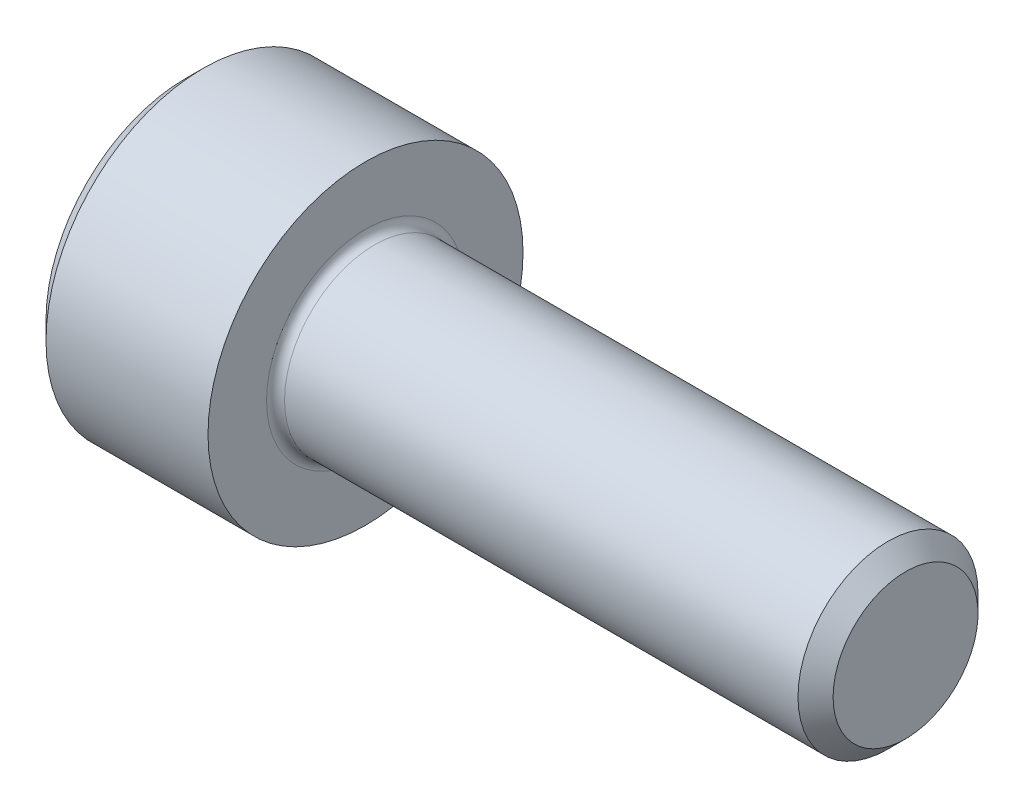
from build123d import *

# Parameters (mm, degrees)
FILLET1_R   = 0.2
HEX_2_DEPTH = 2


with BuildPart() as part:
    # BodySke → Base-Revolve (revolve)
    with BuildSketch(Plane.XY, mode=Mode.PRIVATE) as base_revolve_sk:
        Polygon((0, 0), (0, 3.1), (0.4, 3.5), (4, 3.5), (4, 2), (15.61, 2), (16, 1.61), (16, 0), align=None)
    revolve(base_revolve_sk.sketch.rotate(Axis((-31.75, 0, 0), (1, 0, 0)), 90), axis=Axis((-31.75, 0, 0), (1, 0, 0)))

    # Fillet1
    fillet1_edges = [part.edges().sort_by_distance(p)[0] for p in [
        (4, 0, -2),
    ]]
    fillet(fillet1_edges, radius=FILLET1_R)

    # Sketch2 → Hex-PreBroach (revolve, cut)
    with BuildSketch(Plane.XY, mode=Mode.PRIVATE) as hex_prebroach_sk:
        Polygon((0, 1.5355), (2, 1.5355), (2.886521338, 0), (0, 0), align=None)
    revolve(hex_prebroach_sk.sketch.rotate(Axis((0, 0, 0), (1, 0, 0)), 90), axis=Axis((0, 0, 0), (1, 0, 0)), mode=Mode.SUBTRACT)

    # Sketch3 → Hex 2 (cut)
    with BuildSketch(Plane(origin=(0, 0, 0), x_dir=(0, 0.500000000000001, 0.866025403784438), z_dir=(-1, 0, 0))):
        Polygon((0.886521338, 1.5355), (-0.886521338, 1.5355), (-1.773042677, 0), (-0.886521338, -1.5355), (0.886521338, -1.5355), (1.773042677, 0), align=None)
    extrude(amount=-HEX_2_DEPTH, mode=Mode.SUBTRACT)


solid = part.part
